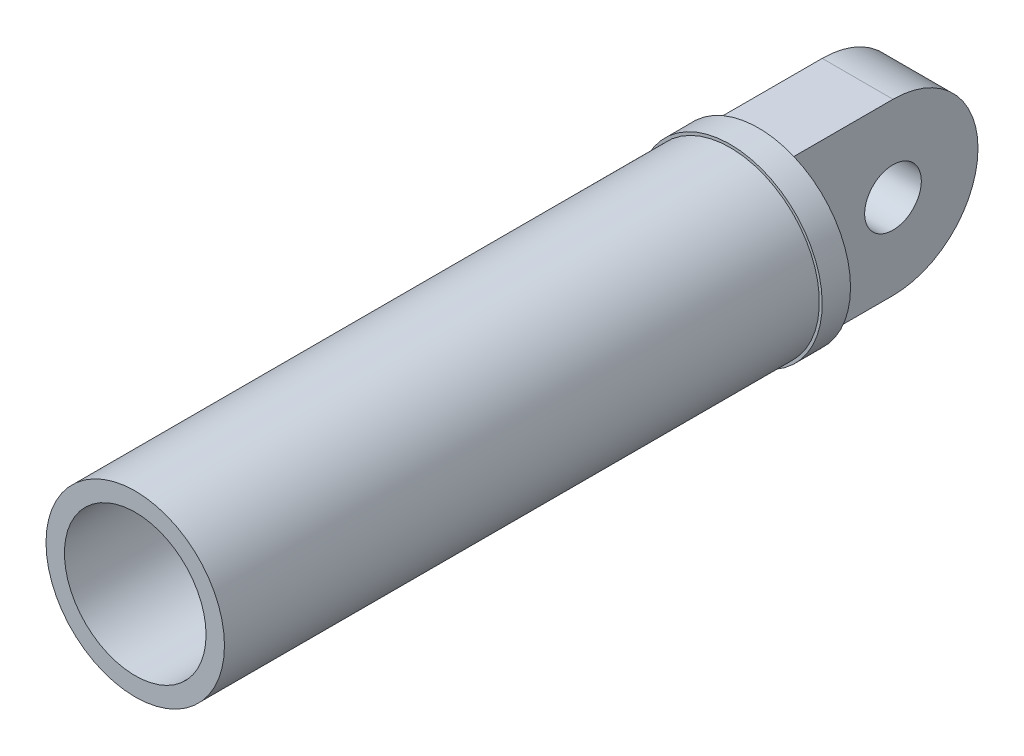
ISO-10303-21;
HEADER;
FILE_DESCRIPTION(('STEP AP214'),'2;1');
FILE_NAME('part.step','',(''),(''),'','','');
FILE_SCHEMA(('AUTOMOTIVE_DESIGN { 1 0 10303 214 1 1 1 1 }'));
ENDSEC;
DATA;
#1=APPLICATION_CONTEXT('core data for automotive mechanical design processes');
#2=APPLICATION_PROTOCOL_DEFINITION('international standard','automotive_design',2000,#1);
#3=PRODUCT_CONTEXT('',#1,'mechanical');
#4=PRODUCT('Part','Part','',(#3));
#5=PRODUCT_RELATED_PRODUCT_CATEGORY('part','',(#4));
#6=PRODUCT_DEFINITION_FORMATION('','',#4);
#7=PRODUCT_DEFINITION_CONTEXT('part definition',#1,'design');
#8=PRODUCT_DEFINITION('design','',#6,#7);
#9=PRODUCT_DEFINITION_SHAPE('','',#8);
#10=(LENGTH_UNIT() NAMED_UNIT(*) SI_UNIT(.MILLI.,.METRE.));
#11=(NAMED_UNIT(*) PLANE_ANGLE_UNIT() SI_UNIT($,.RADIAN.));
#12=(NAMED_UNIT(*) SI_UNIT($,.STERADIAN.) SOLID_ANGLE_UNIT());
#13=UNCERTAINTY_MEASURE_WITH_UNIT(LENGTH_MEASURE(1.E-05),#10,'distance_accuracy_value','');
#14=(GEOMETRIC_REPRESENTATION_CONTEXT(3) GLOBAL_UNCERTAINTY_ASSIGNED_CONTEXT((#13)) GLOBAL_UNIT_ASSIGNED_CONTEXT((#10,
#11,#12)) REPRESENTATION_CONTEXT('',''));
#15=CARTESIAN_POINT('',(0.,0.,0.));
#16=DIRECTION('',(0.,0.,1.));
#17=DIRECTION('',(1.,0.,0.));
#18=AXIS2_PLACEMENT_3D('',#15,#16,#17);
#19=CARTESIAN_POINT('',(0.,0.,-10.));
#20=DIRECTION('',(0.,0.,-1.));
#21=DIRECTION('',(-1.,0.,0.));
#22=AXIS2_PLACEMENT_3D('',#19,#20,#21);
#23=PLANE('',#22);
#24=CARTESIAN_POINT('',(0.,0.,-10.));
#25=DIRECTION('',(0.,0.,-1.));
#26=DIRECTION('',(-1.,0.,0.));
#27=AXIS2_PLACEMENT_3D('',#24,#25,#26);
#28=CIRCLE('',#27,32.5);
#29=CARTESIAN_POINT('',(-12.5,-30.,-10.));
#30=VERTEX_POINT('',#29);
#31=CARTESIAN_POINT('',(-12.5,30.,-10.));
#32=VERTEX_POINT('',#31);
#33=EDGE_CURVE('E124',#30,#32,#28,.T.);
#34=ORIENTED_EDGE('',*,*,#33,.T.);
#35=DIRECTION('',(0.,-1.,0.));
#36=VECTOR('',#35,1.);
#37=CARTESIAN_POINT('',(-12.5,-30.,-10.));
#38=LINE('',#37,#36);
#39=EDGE_CURVE('E54',#32,#30,#38,.T.);
#40=ORIENTED_EDGE('',*,*,#39,.T.);
#41=EDGE_LOOP('',(#34,#40));
#42=FACE_BOUND('',#41,.T.);
#43=ADVANCED_FACE('F39',(#42),#23,.T.);
#44=DIRECTION('',(-1.,0.,0.));
#45=VECTOR('',#44,1.);
#46=CARTESIAN_POINT('',(12.5,-30.,-10.));
#47=LINE('',#46,#45);
#48=CARTESIAN_POINT('',(12.5,-30.,-10.));
#49=VERTEX_POINT('',#48);
#50=EDGE_CURVE('E119',#49,#30,#47,.T.);
#51=ORIENTED_EDGE('',*,*,#50,.F.);
#52=EDGE_CURVE('E191',#49,#30,#28,.T.);
#53=ORIENTED_EDGE('',*,*,#52,.T.);
#54=EDGE_LOOP('',(#51,#53));
#55=FACE_BOUND('',#54,.T.);
#56=ADVANCED_FACE('F163',(#55),#23,.T.);
#57=CARTESIAN_POINT('',(12.5,30.,-10.));
#58=VERTEX_POINT('',#57);
#59=EDGE_CURVE('E125',#32,#58,#28,.T.);
#60=ORIENTED_EDGE('',*,*,#59,.T.);
#61=DIRECTION('',(-1.,0.,0.));
#62=VECTOR('',#61,1.);
#63=CARTESIAN_POINT('',(12.5,30.,-10.));
#64=LINE('',#63,#62);
#65=EDGE_CURVE('E97',#58,#32,#64,.T.);
#66=ORIENTED_EDGE('',*,*,#65,.T.);
#67=EDGE_LOOP('',(#60,#66));
#68=FACE_BOUND('',#67,.T.);
#69=ADVANCED_FACE('F168',(#68),#23,.T.);
#70=CARTESIAN_POINT('',(0.,0.,210.));
#71=DIRECTION('',(0.,0.,1.));
#72=DIRECTION('',(1.,0.,0.));
#73=AXIS2_PLACEMENT_3D('',#70,#71,#72);
#74=PLANE('',#73);
#75=CARTESIAN_POINT('',(0.,0.,210.));
#76=DIRECTION('',(0.,0.,1.));
#77=DIRECTION('',(1.,0.,0.));
#78=AXIS2_PLACEMENT_3D('',#75,#76,#77);
#79=CIRCLE('',#78,31.5);
#80=CARTESIAN_POINT('',(31.5,0.,210.));
#81=VERTEX_POINT('',#80);
#82=EDGE_CURVE('E47',#81,#81,#79,.T.);
#83=ORIENTED_EDGE('',*,*,#82,.T.);
#84=EDGE_LOOP('',(#83));
#85=FACE_BOUND('',#84,.T.);
#86=CARTESIAN_POINT('',(0.,0.,210.));
#87=DIRECTION('',(0.,0.,1.));
#88=DIRECTION('',(1.,0.,0.));
#89=AXIS2_PLACEMENT_3D('',#86,#87,#88);
#90=CIRCLE('',#89,25.);
#91=CARTESIAN_POINT('',(25.,0.,210.));
#92=VERTEX_POINT('',#91);
#93=EDGE_CURVE('E132',#92,#92,#90,.T.);
#94=ORIENTED_EDGE('',*,*,#93,.F.);
#95=EDGE_LOOP('',(#94));
#96=FACE_BOUND('',#95,.T.);
#97=ADVANCED_FACE('F137',(#85,#96),#74,.T.);
#98=CARTESIAN_POINT('',(0.,0.,210.));
#99=DIRECTION('',(0.,0.,-1.));
#100=DIRECTION('',(-1.,0.,0.));
#101=AXIS2_PLACEMENT_3D('',#98,#99,#100);
#102=CYLINDRICAL_SURFACE('',#101,31.5);
#103=ORIENTED_EDGE('',*,*,#82,.F.);
#104=EDGE_LOOP('',(#103));
#105=FACE_BOUND('',#104,.T.);
#106=CARTESIAN_POINT('',(0.,0.,0.));
#107=DIRECTION('',(0.,0.,-1.));
#108=DIRECTION('',(-1.,0.,0.));
#109=AXIS2_PLACEMENT_3D('',#106,#107,#108);
#110=CIRCLE('',#109,31.5);
#111=CARTESIAN_POINT('',(-31.5,0.,0.));
#112=VERTEX_POINT('',#111);
#113=EDGE_CURVE('E128',#112,#112,#110,.T.);
#114=ORIENTED_EDGE('',*,*,#113,.F.);
#115=EDGE_LOOP('',(#114));
#116=FACE_BOUND('',#115,.T.);
#117=ADVANCED_FACE('F41',(#105,#116),#102,.T.);
#118=CARTESIAN_POINT('',(0.,0.,210.));
#119=DIRECTION('',(0.,0.,-1.));
#120=DIRECTION('',(-1.,0.,0.));
#121=AXIS2_PLACEMENT_3D('',#118,#119,#120);
#122=CYLINDRICAL_SURFACE('',#121,25.);
#123=CARTESIAN_POINT('',(0.,0.,10.));
#124=DIRECTION('',(0.,0.,1.));
#125=DIRECTION('',(1.,0.,0.));
#126=AXIS2_PLACEMENT_3D('',#123,#124,#125);
#127=CIRCLE('',#126,25.);
#128=CARTESIAN_POINT('',(25.,0.,10.));
#129=VERTEX_POINT('',#128);
#130=EDGE_CURVE('E11',#129,#129,#127,.T.);
#131=ORIENTED_EDGE('',*,*,#130,.F.);
#132=EDGE_LOOP('',(#131));
#133=FACE_BOUND('',#132,.T.);
#134=ORIENTED_EDGE('',*,*,#93,.T.);
#135=EDGE_LOOP('',(#134));
#136=FACE_BOUND('',#135,.T.);
#137=ADVANCED_FACE('F142',(#133,#136),#122,.F.);
#138=CARTESIAN_POINT('',(0.,0.,0.));
#139=DIRECTION('',(0.,0.,-1.));
#140=DIRECTION('',(-1.,0.,0.));
#141=AXIS2_PLACEMENT_3D('',#138,#139,#140);
#142=PLANE('',#141);
#143=CARTESIAN_POINT('',(0.,0.,0.));
#144=DIRECTION('',(0.,0.,-1.));
#145=DIRECTION('',(-1.,0.,0.));
#146=AXIS2_PLACEMENT_3D('',#143,#144,#145);
#147=CIRCLE('',#146,32.5);
#148=CARTESIAN_POINT('',(-32.5,0.,0.));
#149=VERTEX_POINT('',#148);
#150=EDGE_CURVE('E96',#149,#149,#147,.T.);
#151=ORIENTED_EDGE('',*,*,#150,.F.);
#152=EDGE_LOOP('',(#151));
#153=FACE_BOUND('',#152,.T.);
#154=ORIENTED_EDGE('',*,*,#113,.T.);
#155=EDGE_LOOP('',(#154));
#156=FACE_BOUND('',#155,.T.);
#157=ADVANCED_FACE('F145',(#153,#156),#142,.F.);
#158=CARTESIAN_POINT('',(0.,0.,-10.));
#159=DIRECTION('',(0.,0.,1.));
#160=DIRECTION('',(1.,0.,0.));
#161=AXIS2_PLACEMENT_3D('',#158,#159,#160);
#162=CYLINDRICAL_SURFACE('',#161,32.5);
#163=ORIENTED_EDGE('',*,*,#59,.F.);
#164=ORIENTED_EDGE('',*,*,#33,.F.);
#165=ORIENTED_EDGE('',*,*,#52,.F.);
#166=EDGE_CURVE('E129',#58,#49,#28,.T.);
#167=ORIENTED_EDGE('',*,*,#166,.F.);
#168=EDGE_LOOP('',(#163,#164,#165,#167));
#169=FACE_BOUND('',#168,.T.);
#170=ORIENTED_EDGE('',*,*,#150,.T.);
#171=EDGE_LOOP('',(#170));
#172=FACE_BOUND('',#171,.T.);
#173=ADVANCED_FACE('F147',(#169,#172),#162,.T.);
#174=DIRECTION('',(0.,-1.,0.));
#175=VECTOR('',#174,1.);
#176=CARTESIAN_POINT('',(12.5,-30.,-10.));
#177=LINE('',#176,#175);
#178=EDGE_CURVE('E115',#58,#49,#177,.T.);
#179=ORIENTED_EDGE('',*,*,#178,.F.);
#180=ORIENTED_EDGE('',*,*,#166,.T.);
#181=EDGE_LOOP('',(#179,#180));
#182=FACE_BOUND('',#181,.T.);
#183=ADVANCED_FACE('F154',(#182),#23,.T.);
#184=CARTESIAN_POINT('',(12.5,0.,-45.));
#185=DIRECTION('',(1.,0.,0.));
#186=DIRECTION('',(0.,0.,-1.));
#187=AXIS2_PLACEMENT_3D('',#184,#185,#186);
#188=PLANE('',#187);
#189=CARTESIAN_POINT('',(12.5,0.,-45.));
#190=DIRECTION('',(1.,0.,0.));
#191=DIRECTION('',(0.,0.,-1.));
#192=AXIS2_PLACEMENT_3D('',#189,#190,#191);
#193=CIRCLE('',#192,30.);
#194=CARTESIAN_POINT('',(12.5,-30.,-45.));
#195=VERTEX_POINT('',#194);
#196=CARTESIAN_POINT('',(12.5,30.,-45.));
#197=VERTEX_POINT('',#196);
#198=EDGE_CURVE('E112',#195,#197,#193,.T.);
#199=ORIENTED_EDGE('',*,*,#198,.T.);
#200=DIRECTION('',(0.,0.,1.));
#201=VECTOR('',#200,1.);
#202=CARTESIAN_POINT('',(12.5,30.,-45.));
#203=LINE('',#202,#201);
#204=EDGE_CURVE('E93',#197,#58,#203,.T.);
#205=ORIENTED_EDGE('',*,*,#204,.T.);
#206=ORIENTED_EDGE('',*,*,#178,.T.);
#207=DIRECTION('',(0.,0.,-1.));
#208=VECTOR('',#207,1.);
#209=CARTESIAN_POINT('',(12.5,-30.,-45.));
#210=LINE('',#209,#208);
#211=EDGE_CURVE('E62',#49,#195,#210,.T.);
#212=ORIENTED_EDGE('',*,*,#211,.T.);
#213=EDGE_LOOP('',(#199,#205,#206,#212));
#214=FACE_BOUND('',#213,.T.);
#215=CARTESIAN_POINT('',(12.5,0.,-45.));
#216=DIRECTION('',(1.,0.,0.));
#217=DIRECTION('',(0.,0.,-1.));
#218=AXIS2_PLACEMENT_3D('',#215,#216,#217);
#219=CIRCLE('',#218,10.);
#220=CARTESIAN_POINT('',(12.5,0.,-55.));
#221=VERTEX_POINT('',#220);
#222=EDGE_CURVE('E102',#221,#221,#219,.T.);
#223=ORIENTED_EDGE('',*,*,#222,.F.);
#224=EDGE_LOOP('',(#223));
#225=FACE_BOUND('',#224,.T.);
#226=ADVANCED_FACE('F172',(#214,#225),#188,.T.);
#227=CARTESIAN_POINT('',(-12.5,0.,-45.));
#228=DIRECTION('',(1.,0.,0.));
#229=DIRECTION('',(0.,0.,-1.));
#230=AXIS2_PLACEMENT_3D('',#227,#228,#229);
#231=PLANE('',#230);
#232=CARTESIAN_POINT('',(-12.5,0.,-45.));
#233=DIRECTION('',(1.,0.,0.));
#234=DIRECTION('',(0.,0.,-1.));
#235=AXIS2_PLACEMENT_3D('',#232,#233,#234);
#236=CIRCLE('',#235,30.);
#237=CARTESIAN_POINT('',(-12.5,-30.,-45.));
#238=VERTEX_POINT('',#237);
#239=CARTESIAN_POINT('',(-12.5,30.,-45.));
#240=VERTEX_POINT('',#239);
#241=EDGE_CURVE('E85',#238,#240,#236,.T.);
#242=ORIENTED_EDGE('',*,*,#241,.F.);
#243=DIRECTION('',(0.,0.,-1.));
#244=VECTOR('',#243,1.);
#245=CARTESIAN_POINT('',(-12.5,-30.,-45.));
#246=LINE('',#245,#244);
#247=EDGE_CURVE('E110',#30,#238,#246,.T.);
#248=ORIENTED_EDGE('',*,*,#247,.F.);
#249=ORIENTED_EDGE('',*,*,#39,.F.);
#250=DIRECTION('',(0.,0.,1.));
#251=VECTOR('',#250,1.);
#252=CARTESIAN_POINT('',(-12.5,30.,-45.));
#253=LINE('',#252,#251);
#254=EDGE_CURVE('E80',#240,#32,#253,.T.);
#255=ORIENTED_EDGE('',*,*,#254,.F.);
#256=EDGE_LOOP('',(#242,#248,#249,#255));
#257=FACE_BOUND('',#256,.T.);
#258=CARTESIAN_POINT('',(-12.5,0.,-45.));
#259=DIRECTION('',(1.,0.,0.));
#260=DIRECTION('',(0.,0.,-1.));
#261=AXIS2_PLACEMENT_3D('',#258,#259,#260);
#262=CIRCLE('',#261,10.);
#263=CARTESIAN_POINT('',(-12.5,0.,-55.));
#264=VERTEX_POINT('',#263);
#265=EDGE_CURVE('E105',#264,#264,#262,.T.);
#266=ORIENTED_EDGE('',*,*,#265,.T.);
#267=EDGE_LOOP('',(#266));
#268=FACE_BOUND('',#267,.T.);
#269=ADVANCED_FACE('F82',(#257,#268),#231,.F.);
#270=CARTESIAN_POINT('',(12.5,0.,-45.));
#271=DIRECTION('',(-1.,0.,0.));
#272=DIRECTION('',(0.,0.,1.));
#273=AXIS2_PLACEMENT_3D('',#270,#271,#272);
#274=CYLINDRICAL_SURFACE('',#273,30.);
#275=ORIENTED_EDGE('',*,*,#241,.T.);
#276=DIRECTION('',(-1.,0.,0.));
#277=VECTOR('',#276,1.);
#278=CARTESIAN_POINT('',(12.5,30.,-45.));
#279=LINE('',#278,#277);
#280=EDGE_CURVE('E91',#197,#240,#279,.T.);
#281=ORIENTED_EDGE('',*,*,#280,.F.);
#282=ORIENTED_EDGE('',*,*,#198,.F.);
#283=DIRECTION('',(-1.,0.,0.));
#284=VECTOR('',#283,1.);
#285=CARTESIAN_POINT('',(12.5,-30.,-45.));
#286=LINE('',#285,#284);
#287=EDGE_CURVE('E101',#195,#238,#286,.T.);
#288=ORIENTED_EDGE('',*,*,#287,.T.);
#289=EDGE_LOOP('',(#275,#281,#282,#288));
#290=FACE_BOUND('',#289,.T.);
#291=ADVANCED_FACE('F100',(#290),#274,.T.);
#292=CARTESIAN_POINT('',(12.5,30.,-45.));
#293=DIRECTION('',(0.,-1.,0.));
#294=DIRECTION('',(0.,0.,-1.));
#295=AXIS2_PLACEMENT_3D('',#292,#293,#294);
#296=PLANE('',#295);
#297=ORIENTED_EDGE('',*,*,#254,.T.);
#298=ORIENTED_EDGE('',*,*,#65,.F.);
#299=ORIENTED_EDGE('',*,*,#204,.F.);
#300=ORIENTED_EDGE('',*,*,#280,.T.);
#301=EDGE_LOOP('',(#297,#298,#299,#300));
#302=FACE_BOUND('',#301,.T.);
#303=ADVANCED_FACE('F92',(#302),#296,.F.);
#304=CARTESIAN_POINT('',(12.5,-30.,-45.));
#305=DIRECTION('',(0.,1.,0.));
#306=DIRECTION('',(0.,0.,1.));
#307=AXIS2_PLACEMENT_3D('',#304,#305,#306);
#308=PLANE('',#307);
#309=ORIENTED_EDGE('',*,*,#247,.T.);
#310=ORIENTED_EDGE('',*,*,#287,.F.);
#311=ORIENTED_EDGE('',*,*,#211,.F.);
#312=ORIENTED_EDGE('',*,*,#50,.T.);
#313=EDGE_LOOP('',(#309,#310,#311,#312));
#314=FACE_BOUND('',#313,.T.);
#315=ADVANCED_FACE('F194',(#314),#308,.F.);
#316=CARTESIAN_POINT('',(12.5,0.,-45.));
#317=DIRECTION('',(-1.,0.,0.));
#318=DIRECTION('',(0.,0.,1.));
#319=AXIS2_PLACEMENT_3D('',#316,#317,#318);
#320=CYLINDRICAL_SURFACE('',#319,10.);
#321=ORIENTED_EDGE('',*,*,#222,.T.);
#322=EDGE_LOOP('',(#321));
#323=FACE_BOUND('',#322,.T.);
#324=ORIENTED_EDGE('',*,*,#265,.F.);
#325=EDGE_LOOP('',(#324));
#326=FACE_BOUND('',#325,.T.);
#327=ADVANCED_FACE('F198',(#323,#326),#320,.F.);
#328=CARTESIAN_POINT('',(0.,0.,10.));
#329=DIRECTION('',(0.,0.,1.));
#330=DIRECTION('',(1.,0.,0.));
#331=AXIS2_PLACEMENT_3D('',#328,#329,#330);
#332=PLANE('',#331);
#333=ORIENTED_EDGE('',*,*,#130,.T.);
#334=EDGE_LOOP('',(#333));
#335=FACE_BOUND('',#334,.T.);
#336=ADVANCED_FACE('F201',(#335),#332,.T.);
#337=CLOSED_SHELL('',(#43,#56,#69,#97,#117,#137,#157,#173,#183,#226,#269,#291,#303,#315,#327,#336));
#338=MANIFOLD_SOLID_BREP('B2',#337);
#339=ADVANCED_BREP_SHAPE_REPRESENTATION('',(#18,#338),#14);
#340=SHAPE_DEFINITION_REPRESENTATION(#9,#339);
ENDSEC;
END-ISO-10303-21;
